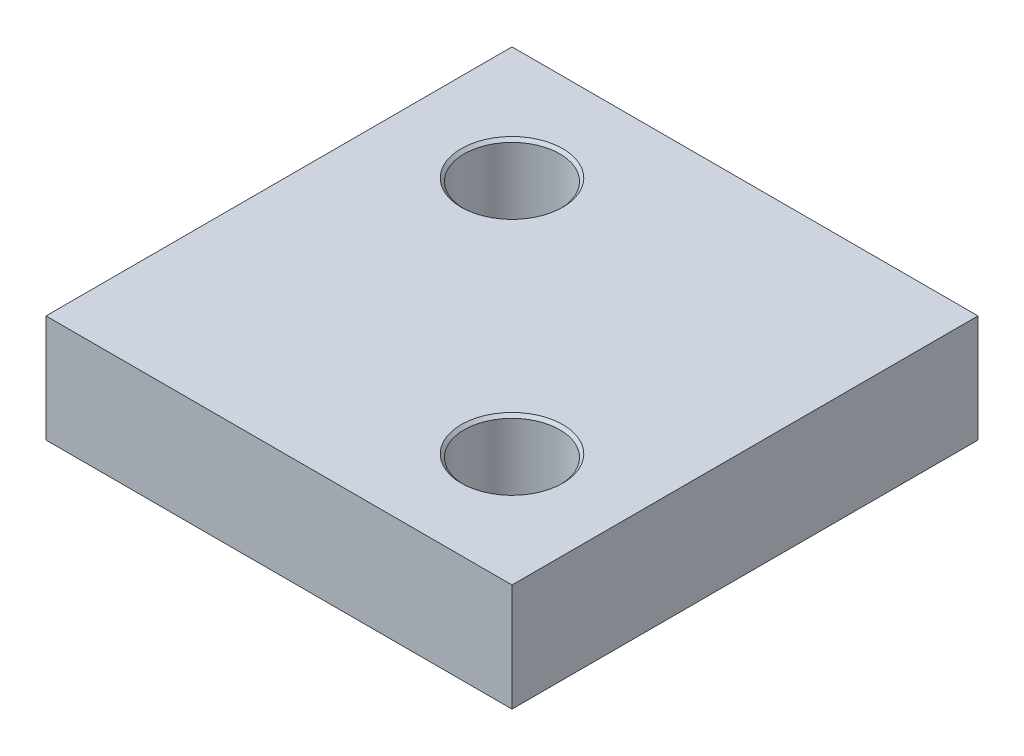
ISO-10303-21;
HEADER;
FILE_DESCRIPTION(('STEP AP214'),'2;1');
FILE_NAME('part.step','',(''),(''),'','','');
FILE_SCHEMA(('AUTOMOTIVE_DESIGN { 1 0 10303 214 1 1 1 1 }'));
ENDSEC;
DATA;
#1=APPLICATION_CONTEXT('core data for automotive mechanical design processes');
#2=APPLICATION_PROTOCOL_DEFINITION('international standard','automotive_design',2000,#1);
#3=PRODUCT_CONTEXT('',#1,'mechanical');
#4=PRODUCT('Part','Part','',(#3));
#5=PRODUCT_RELATED_PRODUCT_CATEGORY('part','',(#4));
#6=PRODUCT_DEFINITION_FORMATION('','',#4);
#7=PRODUCT_DEFINITION_CONTEXT('part definition',#1,'design');
#8=PRODUCT_DEFINITION('design','',#6,#7);
#9=PRODUCT_DEFINITION_SHAPE('','',#8);
#10=(LENGTH_UNIT() NAMED_UNIT(*) SI_UNIT(.MILLI.,.METRE.));
#11=(NAMED_UNIT(*) PLANE_ANGLE_UNIT() SI_UNIT($,.RADIAN.));
#12=(NAMED_UNIT(*) SI_UNIT($,.STERADIAN.) SOLID_ANGLE_UNIT());
#13=UNCERTAINTY_MEASURE_WITH_UNIT(LENGTH_MEASURE(1.E-05),#10,'distance_accuracy_value','');
#14=(GEOMETRIC_REPRESENTATION_CONTEXT(3) GLOBAL_UNCERTAINTY_ASSIGNED_CONTEXT((#13)) GLOBAL_UNIT_ASSIGNED_CONTEXT((#10,
#11,#12)) REPRESENTATION_CONTEXT('',''));
#15=CARTESIAN_POINT('',(0.,0.,0.));
#16=DIRECTION('',(0.,0.,1.));
#17=DIRECTION('',(1.,0.,0.));
#18=AXIS2_PLACEMENT_3D('',#15,#16,#17);
#19=CARTESIAN_POINT('',(0.,36.,0.));
#20=DIRECTION('',(0.,1.,0.));
#21=DIRECTION('',(0.,0.,1.));
#22=AXIS2_PLACEMENT_3D('',#19,#20,#21);
#23=PLANE('',#22);
#24=CARTESIAN_POINT('',(-40.,36.,-40.));
#25=DIRECTION('',(0.,1.,0.));
#26=DIRECTION('',(0.,0.,1.));
#27=AXIS2_PLACEMENT_3D('',#24,#25,#26);
#28=CIRCLE('',#27,17.);
#29=CARTESIAN_POINT('',(-40.,36.,-23.));
#30=VERTEX_POINT('',#29);
#31=EDGE_CURVE('E154',#30,#30,#28,.F.);
#32=ORIENTED_EDGE('',*,*,#31,.T.);
#33=EDGE_LOOP('',(#32));
#34=FACE_BOUND('',#33,.T.);
#35=CARTESIAN_POINT('',(40.,36.,40.));
#36=DIRECTION('',(0.,1.,0.));
#37=DIRECTION('',(0.,0.,1.));
#38=AXIS2_PLACEMENT_3D('',#35,#36,#37);
#39=CIRCLE('',#38,17.);
#40=CARTESIAN_POINT('',(40.,36.,57.));
#41=VERTEX_POINT('',#40);
#42=EDGE_CURVE('E151',#41,#41,#39,.F.);
#43=ORIENTED_EDGE('',*,*,#42,.T.);
#44=EDGE_LOOP('',(#43));
#45=FACE_BOUND('',#44,.T.);
#46=DIRECTION('',(0.,0.,1.));
#47=VECTOR('',#46,1.);
#48=CARTESIAN_POINT('',(-78.,36.,78.));
#49=LINE('',#48,#47);
#50=CARTESIAN_POINT('',(-78.,36.,-78.));
#51=VERTEX_POINT('',#50);
#52=CARTESIAN_POINT('',(-78.,36.,78.));
#53=VERTEX_POINT('',#52);
#54=EDGE_CURVE('E107',#51,#53,#49,.T.);
#55=ORIENTED_EDGE('',*,*,#54,.T.);
#56=DIRECTION('',(1.,0.,0.));
#57=VECTOR('',#56,1.);
#58=CARTESIAN_POINT('',(78.,36.,78.));
#59=LINE('',#58,#57);
#60=CARTESIAN_POINT('',(78.,36.,78.));
#61=VERTEX_POINT('',#60);
#62=EDGE_CURVE('E67',#53,#61,#59,.T.);
#63=ORIENTED_EDGE('',*,*,#62,.T.);
#64=DIRECTION('',(0.,0.,-1.));
#65=VECTOR('',#64,1.);
#66=CARTESIAN_POINT('',(78.,36.,78.));
#67=LINE('',#66,#65);
#68=CARTESIAN_POINT('',(78.,36.,-78.));
#69=VERTEX_POINT('',#68);
#70=EDGE_CURVE('E110',#61,#69,#67,.T.);
#71=ORIENTED_EDGE('',*,*,#70,.T.);
#72=DIRECTION('',(-1.,0.,0.));
#73=VECTOR('',#72,1.);
#74=CARTESIAN_POINT('',(78.,36.,-78.));
#75=LINE('',#74,#73);
#76=EDGE_CURVE('E35',#69,#51,#75,.T.);
#77=ORIENTED_EDGE('',*,*,#76,.T.);
#78=EDGE_LOOP('',(#55,#63,#71,#77));
#79=FACE_BOUND('',#78,.T.);
#80=ADVANCED_FACE('F16',(#34,#45,#79),#23,.T.);
#81=CARTESIAN_POINT('',(0.,0.,0.));
#82=DIRECTION('',(0.,1.,0.));
#83=DIRECTION('',(0.,0.,1.));
#84=AXIS2_PLACEMENT_3D('',#81,#82,#83);
#85=PLANE('',#84);
#86=CARTESIAN_POINT('',(-40.,0.,-40.));
#87=DIRECTION('',(0.,1.,0.));
#88=DIRECTION('',(0.,0.,1.));
#89=AXIS2_PLACEMENT_3D('',#86,#87,#88);
#90=CIRCLE('',#89,17.);
#91=CARTESIAN_POINT('',(-40.,0.,-23.));
#92=VERTEX_POINT('',#91);
#93=EDGE_CURVE('E142',#92,#92,#90,.T.);
#94=ORIENTED_EDGE('',*,*,#93,.T.);
#95=EDGE_LOOP('',(#94));
#96=FACE_BOUND('',#95,.T.);
#97=CARTESIAN_POINT('',(40.,0.,40.));
#98=DIRECTION('',(0.,1.,0.));
#99=DIRECTION('',(0.,0.,1.));
#100=AXIS2_PLACEMENT_3D('',#97,#98,#99);
#101=CIRCLE('',#100,17.);
#102=CARTESIAN_POINT('',(40.,0.,57.));
#103=VERTEX_POINT('',#102);
#104=EDGE_CURVE('E139',#103,#103,#101,.T.);
#105=ORIENTED_EDGE('',*,*,#104,.T.);
#106=EDGE_LOOP('',(#105));
#107=FACE_BOUND('',#106,.T.);
#108=CARTESIAN_POINT('',(66.,0.,40.));
#109=DIRECTION('',(0.,1.,0.));
#110=DIRECTION('',(0.,0.,1.));
#111=AXIS2_PLACEMENT_3D('',#108,#109,#110);
#112=CIRCLE('',#111,3.5);
#113=CARTESIAN_POINT('',(66.,0.,43.5));
#114=VERTEX_POINT('',#113);
#115=EDGE_CURVE('E136',#114,#114,#112,.T.);
#116=ORIENTED_EDGE('',*,*,#115,.T.);
#117=EDGE_LOOP('',(#116));
#118=FACE_BOUND('',#117,.T.);
#119=CARTESIAN_POINT('',(14.,0.,40.));
#120=DIRECTION('',(0.,1.,0.));
#121=DIRECTION('',(0.,0.,1.));
#122=AXIS2_PLACEMENT_3D('',#119,#120,#121);
#123=CIRCLE('',#122,3.5);
#124=CARTESIAN_POINT('',(14.,0.,43.5));
#125=VERTEX_POINT('',#124);
#126=EDGE_CURVE('E133',#125,#125,#123,.T.);
#127=ORIENTED_EDGE('',*,*,#126,.T.);
#128=EDGE_LOOP('',(#127));
#129=FACE_BOUND('',#128,.T.);
#130=CARTESIAN_POINT('',(-14.,0.,-40.));
#131=DIRECTION('',(0.,1.,0.));
#132=DIRECTION('',(0.,0.,1.));
#133=AXIS2_PLACEMENT_3D('',#130,#131,#132);
#134=CIRCLE('',#133,3.5);
#135=CARTESIAN_POINT('',(-14.,0.,-36.5));
#136=VERTEX_POINT('',#135);
#137=EDGE_CURVE('E130',#136,#136,#134,.T.);
#138=ORIENTED_EDGE('',*,*,#137,.T.);
#139=EDGE_LOOP('',(#138));
#140=FACE_BOUND('',#139,.T.);
#141=CARTESIAN_POINT('',(-66.,0.,-40.));
#142=DIRECTION('',(0.,1.,0.));
#143=DIRECTION('',(0.,0.,1.));
#144=AXIS2_PLACEMENT_3D('',#141,#142,#143);
#145=CIRCLE('',#144,3.5);
#146=CARTESIAN_POINT('',(-66.,0.,-36.5));
#147=VERTEX_POINT('',#146);
#148=EDGE_CURVE('E127',#147,#147,#145,.T.);
#149=ORIENTED_EDGE('',*,*,#148,.T.);
#150=EDGE_LOOP('',(#149));
#151=FACE_BOUND('',#150,.T.);
#152=DIRECTION('',(0.,0.,1.));
#153=VECTOR('',#152,1.);
#154=CARTESIAN_POINT('',(-78.,0.,78.));
#155=LINE('',#154,#153);
#156=CARTESIAN_POINT('',(-78.,0.,-78.));
#157=VERTEX_POINT('',#156);
#158=CARTESIAN_POINT('',(-78.,0.,78.));
#159=VERTEX_POINT('',#158);
#160=EDGE_CURVE('E106',#157,#159,#155,.T.);
#161=ORIENTED_EDGE('',*,*,#160,.F.);
#162=DIRECTION('',(-1.,0.,0.));
#163=VECTOR('',#162,1.);
#164=CARTESIAN_POINT('',(78.,0.,-78.));
#165=LINE('',#164,#163);
#166=CARTESIAN_POINT('',(78.,0.,-78.));
#167=VERTEX_POINT('',#166);
#168=EDGE_CURVE('E59',#167,#157,#165,.T.);
#169=ORIENTED_EDGE('',*,*,#168,.F.);
#170=DIRECTION('',(0.,0.,-1.));
#171=VECTOR('',#170,1.);
#172=CARTESIAN_POINT('',(78.,0.,78.));
#173=LINE('',#172,#171);
#174=CARTESIAN_POINT('',(78.,0.,78.));
#175=VERTEX_POINT('',#174);
#176=EDGE_CURVE('E53',#175,#167,#173,.T.);
#177=ORIENTED_EDGE('',*,*,#176,.F.);
#178=DIRECTION('',(1.,0.,0.));
#179=VECTOR('',#178,1.);
#180=CARTESIAN_POINT('',(78.,0.,78.));
#181=LINE('',#180,#179);
#182=EDGE_CURVE('E116',#159,#175,#181,.T.);
#183=ORIENTED_EDGE('',*,*,#182,.F.);
#184=EDGE_LOOP('',(#161,#169,#177,#183));
#185=FACE_BOUND('',#184,.T.);
#186=ADVANCED_FACE('F203',(#96,#107,#118,#129,#140,#151,#185),#85,.F.);
#187=CARTESIAN_POINT('',(-78.,36.,78.));
#188=DIRECTION('',(1.,0.,0.));
#189=DIRECTION('',(0.,0.,-1.));
#190=AXIS2_PLACEMENT_3D('',#187,#188,#189);
#191=PLANE('',#190);
#192=ORIENTED_EDGE('',*,*,#160,.T.);
#193=DIRECTION('',(0.,-1.,0.));
#194=VECTOR('',#193,1.);
#195=CARTESIAN_POINT('',(-78.,36.,78.));
#196=LINE('',#195,#194);
#197=EDGE_CURVE('E125',#53,#159,#196,.T.);
#198=ORIENTED_EDGE('',*,*,#197,.F.);
#199=ORIENTED_EDGE('',*,*,#54,.F.);
#200=DIRECTION('',(0.,-1.,0.));
#201=VECTOR('',#200,1.);
#202=CARTESIAN_POINT('',(-78.,36.,-78.));
#203=LINE('',#202,#201);
#204=EDGE_CURVE('E113',#51,#157,#203,.T.);
#205=ORIENTED_EDGE('',*,*,#204,.T.);
#206=EDGE_LOOP('',(#192,#198,#199,#205));
#207=FACE_BOUND('',#206,.T.);
#208=ADVANCED_FACE('F210',(#207),#191,.F.);
#209=CARTESIAN_POINT('',(78.,36.,78.));
#210=DIRECTION('',(0.,0.,-1.));
#211=DIRECTION('',(-1.,0.,0.));
#212=AXIS2_PLACEMENT_3D('',#209,#210,#211);
#213=PLANE('',#212);
#214=ORIENTED_EDGE('',*,*,#182,.T.);
#215=DIRECTION('',(0.,-1.,0.));
#216=VECTOR('',#215,1.);
#217=CARTESIAN_POINT('',(78.,36.,78.));
#218=LINE('',#217,#216);
#219=EDGE_CURVE('E123',#61,#175,#218,.T.);
#220=ORIENTED_EDGE('',*,*,#219,.F.);
#221=ORIENTED_EDGE('',*,*,#62,.F.);
#222=ORIENTED_EDGE('',*,*,#197,.T.);
#223=EDGE_LOOP('',(#214,#220,#221,#222));
#224=FACE_BOUND('',#223,.T.);
#225=ADVANCED_FACE('F224',(#224),#213,.F.);
#226=CARTESIAN_POINT('',(78.,36.,78.));
#227=DIRECTION('',(-1.,0.,0.));
#228=DIRECTION('',(0.,0.,1.));
#229=AXIS2_PLACEMENT_3D('',#226,#227,#228);
#230=PLANE('',#229);
#231=ORIENTED_EDGE('',*,*,#176,.T.);
#232=DIRECTION('',(0.,-1.,0.));
#233=VECTOR('',#232,1.);
#234=CARTESIAN_POINT('',(78.,36.,-78.));
#235=LINE('',#234,#233);
#236=EDGE_CURVE('E121',#69,#167,#235,.T.);
#237=ORIENTED_EDGE('',*,*,#236,.F.);
#238=ORIENTED_EDGE('',*,*,#70,.F.);
#239=ORIENTED_EDGE('',*,*,#219,.T.);
#240=EDGE_LOOP('',(#231,#237,#238,#239));
#241=FACE_BOUND('',#240,.T.);
#242=ADVANCED_FACE('F221',(#241),#230,.F.);
#243=CARTESIAN_POINT('',(78.,36.,-78.));
#244=DIRECTION('',(0.,0.,1.));
#245=DIRECTION('',(1.,0.,0.));
#246=AXIS2_PLACEMENT_3D('',#243,#244,#245);
#247=PLANE('',#246);
#248=ORIENTED_EDGE('',*,*,#168,.T.);
#249=ORIENTED_EDGE('',*,*,#204,.F.);
#250=ORIENTED_EDGE('',*,*,#76,.F.);
#251=ORIENTED_EDGE('',*,*,#236,.T.);
#252=EDGE_LOOP('',(#248,#249,#250,#251));
#253=FACE_BOUND('',#252,.T.);
#254=ADVANCED_FACE('F218',(#253),#247,.F.);
#255=CARTESIAN_POINT('',(-40.,36.,-40.));
#256=DIRECTION('',(0.,-1.,0.));
#257=DIRECTION('',(0.,0.,-1.));
#258=AXIS2_PLACEMENT_3D('',#255,#256,#257);
#259=CYLINDRICAL_SURFACE('',#258,16.);
#260=CARTESIAN_POINT('',(-40.,1.,-40.));
#261=DIRECTION('',(0.,1.,0.));
#262=DIRECTION('',(0.,0.,1.));
#263=AXIS2_PLACEMENT_3D('',#260,#261,#262);
#264=CIRCLE('',#263,16.);
#265=CARTESIAN_POINT('',(-40.,1.,-24.));
#266=VERTEX_POINT('',#265);
#267=EDGE_CURVE('E148',#266,#266,#264,.F.);
#268=ORIENTED_EDGE('',*,*,#267,.T.);
#269=EDGE_LOOP('',(#268));
#270=FACE_BOUND('',#269,.T.);
#271=CARTESIAN_POINT('',(-40.,35.,-40.));
#272=DIRECTION('',(0.,1.,0.));
#273=DIRECTION('',(0.,0.,1.));
#274=AXIS2_PLACEMENT_3D('',#271,#272,#273);
#275=CIRCLE('',#274,16.);
#276=CARTESIAN_POINT('',(-40.,35.,-24.));
#277=VERTEX_POINT('',#276);
#278=EDGE_CURVE('E145',#277,#277,#275,.T.);
#279=ORIENTED_EDGE('',*,*,#278,.T.);
#280=EDGE_LOOP('',(#279));
#281=FACE_BOUND('',#280,.T.);
#282=ADVANCED_FACE('F215',(#270,#281),#259,.F.);
#283=CARTESIAN_POINT('',(40.,36.,40.));
#284=DIRECTION('',(0.,-1.,0.));
#285=DIRECTION('',(0.,0.,-1.));
#286=AXIS2_PLACEMENT_3D('',#283,#284,#285);
#287=CYLINDRICAL_SURFACE('',#286,16.);
#288=CARTESIAN_POINT('',(40.,1.,40.));
#289=DIRECTION('',(0.,1.,0.));
#290=DIRECTION('',(0.,0.,1.));
#291=AXIS2_PLACEMENT_3D('',#288,#289,#290);
#292=CIRCLE('',#291,16.);
#293=CARTESIAN_POINT('',(40.,1.,56.));
#294=VERTEX_POINT('',#293);
#295=EDGE_CURVE('E10',#294,#294,#292,.F.);
#296=ORIENTED_EDGE('',*,*,#295,.T.);
#297=EDGE_LOOP('',(#296));
#298=FACE_BOUND('',#297,.T.);
#299=CARTESIAN_POINT('',(40.,35.,40.));
#300=DIRECTION('',(0.,1.,0.));
#301=DIRECTION('',(0.,0.,1.));
#302=AXIS2_PLACEMENT_3D('',#299,#300,#301);
#303=CIRCLE('',#302,16.);
#304=CARTESIAN_POINT('',(40.,35.,56.));
#305=VERTEX_POINT('',#304);
#306=EDGE_CURVE('E26',#305,#305,#303,.T.);
#307=ORIENTED_EDGE('',*,*,#306,.T.);
#308=EDGE_LOOP('',(#307));
#309=FACE_BOUND('',#308,.T.);
#310=ADVANCED_FACE('F234',(#298,#309),#287,.F.);
#311=CARTESIAN_POINT('',(-40.,0.,-40.));
#312=DIRECTION('',(0.,-1.,0.));
#313=DIRECTION('',(0.,0.,-1.));
#314=AXIS2_PLACEMENT_3D('',#311,#312,#313);
#315=CONICAL_SURFACE('',#314,17.,0.785398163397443);
#316=ORIENTED_EDGE('',*,*,#267,.F.);
#317=EDGE_LOOP('',(#316));
#318=FACE_BOUND('',#317,.T.);
#319=ORIENTED_EDGE('',*,*,#93,.F.);
#320=EDGE_LOOP('',(#319));
#321=FACE_BOUND('',#320,.T.);
#322=ADVANCED_FACE('F230',(#318,#321),#315,.F.);
#323=CARTESIAN_POINT('',(-40.,35.,-40.));
#324=DIRECTION('',(0.,1.,0.));
#325=DIRECTION('',(0.,0.,1.));
#326=AXIS2_PLACEMENT_3D('',#323,#324,#325);
#327=CONICAL_SURFACE('',#326,16.,0.785398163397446);
#328=ORIENTED_EDGE('',*,*,#31,.F.);
#329=EDGE_LOOP('',(#328));
#330=FACE_BOUND('',#329,.T.);
#331=ORIENTED_EDGE('',*,*,#278,.F.);
#332=EDGE_LOOP('',(#331));
#333=FACE_BOUND('',#332,.T.);
#334=ADVANCED_FACE('F233',(#330,#333),#327,.F.);
#335=CARTESIAN_POINT('',(40.,0.,40.));
#336=DIRECTION('',(0.,-1.,0.));
#337=DIRECTION('',(0.,0.,-1.));
#338=AXIS2_PLACEMENT_3D('',#335,#336,#337);
#339=CONICAL_SURFACE('',#338,17.,0.785398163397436);
#340=ORIENTED_EDGE('',*,*,#295,.F.);
#341=EDGE_LOOP('',(#340));
#342=FACE_BOUND('',#341,.T.);
#343=ORIENTED_EDGE('',*,*,#104,.F.);
#344=EDGE_LOOP('',(#343));
#345=FACE_BOUND('',#344,.T.);
#346=ADVANCED_FACE('F238',(#342,#345),#339,.F.);
#347=CARTESIAN_POINT('',(40.,35.,40.));
#348=DIRECTION('',(0.,1.,0.));
#349=DIRECTION('',(0.,0.,1.));
#350=AXIS2_PLACEMENT_3D('',#347,#348,#349);
#351=CONICAL_SURFACE('',#350,16.,0.785398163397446);
#352=ORIENTED_EDGE('',*,*,#42,.F.);
#353=EDGE_LOOP('',(#352));
#354=FACE_BOUND('',#353,.T.);
#355=ORIENTED_EDGE('',*,*,#306,.F.);
#356=EDGE_LOOP('',(#355));
#357=FACE_BOUND('',#356,.T.);
#358=ADVANCED_FACE('F242',(#354,#357),#351,.F.);
#359=CARTESIAN_POINT('',(66.,1.,40.));
#360=DIRECTION('',(0.,-1.,0.));
#361=DIRECTION('',(0.,0.,-1.));
#362=AXIS2_PLACEMENT_3D('',#359,#360,#361);
#363=CONICAL_SURFACE('',#362,2.5,0.785398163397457);
#364=CARTESIAN_POINT('',(66.,0.499999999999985,40.));
#365=DIRECTION('',(0.,-1.,0.));
#366=DIRECTION('',(0.,0.,-1.));
#367=AXIS2_PLACEMENT_3D('',#364,#365,#366);
#368=CIRCLE('',#367,3.);
#369=CARTESIAN_POINT('',(66.,0.499999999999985,37.));
#370=VERTEX_POINT('',#369);
#371=EDGE_CURVE('E169',#370,#370,#368,.T.);
#372=ORIENTED_EDGE('',*,*,#371,.F.);
#373=EDGE_LOOP('',(#372));
#374=FACE_BOUND('',#373,.T.);
#375=ORIENTED_EDGE('',*,*,#115,.F.);
#376=EDGE_LOOP('',(#375));
#377=FACE_BOUND('',#376,.T.);
#378=ADVANCED_FACE('F246',(#374,#377),#363,.F.);
#379=CARTESIAN_POINT('',(14.,1.,40.));
#380=DIRECTION('',(0.,-1.,0.));
#381=DIRECTION('',(0.,0.,-1.));
#382=AXIS2_PLACEMENT_3D('',#379,#380,#381);
#383=CONICAL_SURFACE('',#382,2.5,0.785398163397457);
#384=CARTESIAN_POINT('',(14.,0.499999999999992,40.));
#385=DIRECTION('',(0.,-1.,0.));
#386=DIRECTION('',(0.,0.,-1.));
#387=AXIS2_PLACEMENT_3D('',#384,#385,#386);
#388=CIRCLE('',#387,3.);
#389=CARTESIAN_POINT('',(14.,0.499999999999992,37.));
#390=VERTEX_POINT('',#389);
#391=EDGE_CURVE('E166',#390,#390,#388,.T.);
#392=ORIENTED_EDGE('',*,*,#391,.F.);
#393=EDGE_LOOP('',(#392));
#394=FACE_BOUND('',#393,.T.);
#395=ORIENTED_EDGE('',*,*,#126,.F.);
#396=EDGE_LOOP('',(#395));
#397=FACE_BOUND('',#396,.T.);
#398=ADVANCED_FACE('F250',(#394,#397),#383,.F.);
#399=CARTESIAN_POINT('',(-14.,0.999999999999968,-40.));
#400=DIRECTION('',(0.,-1.,0.));
#401=DIRECTION('',(0.,0.,-1.));
#402=AXIS2_PLACEMENT_3D('',#399,#400,#401);
#403=CONICAL_SURFACE('',#402,2.5,0.785398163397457);
#404=CARTESIAN_POINT('',(-14.,0.499999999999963,-40.));
#405=DIRECTION('',(0.,-1.,0.));
#406=DIRECTION('',(0.,0.,-1.));
#407=AXIS2_PLACEMENT_3D('',#404,#405,#406);
#408=CIRCLE('',#407,3.);
#409=CARTESIAN_POINT('',(-14.,0.499999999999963,-43.));
#410=VERTEX_POINT('',#409);
#411=EDGE_CURVE('E162',#410,#410,#408,.T.);
#412=ORIENTED_EDGE('',*,*,#411,.F.);
#413=EDGE_LOOP('',(#412));
#414=FACE_BOUND('',#413,.T.);
#415=ORIENTED_EDGE('',*,*,#137,.F.);
#416=EDGE_LOOP('',(#415));
#417=FACE_BOUND('',#416,.T.);
#418=ADVANCED_FACE('F253',(#414,#417),#403,.F.);
#419=CARTESIAN_POINT('',(-66.,1.,-40.));
#420=DIRECTION('',(0.,-1.,0.));
#421=DIRECTION('',(0.,0.,-1.));
#422=AXIS2_PLACEMENT_3D('',#419,#420,#421);
#423=CONICAL_SURFACE('',#422,2.5,0.785398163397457);
#424=CARTESIAN_POINT('',(-66.,0.499999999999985,-40.));
#425=DIRECTION('',(0.,-1.,0.));
#426=DIRECTION('',(0.,0.,-1.));
#427=AXIS2_PLACEMENT_3D('',#424,#425,#426);
#428=CIRCLE('',#427,3.);
#429=CARTESIAN_POINT('',(-66.,0.499999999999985,-43.));
#430=VERTEX_POINT('',#429);
#431=EDGE_CURVE('E159',#430,#430,#428,.T.);
#432=ORIENTED_EDGE('',*,*,#431,.F.);
#433=EDGE_LOOP('',(#432));
#434=FACE_BOUND('',#433,.T.);
#435=ORIENTED_EDGE('',*,*,#148,.F.);
#436=EDGE_LOOP('',(#435));
#437=FACE_BOUND('',#436,.T.);
#438=ADVANCED_FACE('F18',(#434,#437),#423,.F.);
#439=CARTESIAN_POINT('',(-66.,15.,-40.));
#440=DIRECTION('',(0.,-1.,0.));
#441=DIRECTION('',(0.,0.,-1.));
#442=AXIS2_PLACEMENT_3D('',#439,#440,#441);
#443=PLANE('',#442);
#444=CARTESIAN_POINT('',(-66.,15.,-40.));
#445=DIRECTION('',(0.,-1.,0.));
#446=DIRECTION('',(0.,0.,-1.));
#447=AXIS2_PLACEMENT_3D('',#444,#445,#446);
#448=CIRCLE('',#447,3.);
#449=CARTESIAN_POINT('',(-66.,15.,-43.));
#450=VERTEX_POINT('',#449);
#451=EDGE_CURVE('E98',#450,#450,#448,.T.);
#452=ORIENTED_EDGE('',*,*,#451,.T.);
#453=EDGE_LOOP('',(#452));
#454=FACE_BOUND('',#453,.T.);
#455=CARTESIAN_POINT('',(-66.,15.,-40.));
#456=DIRECTION('',(0.,-1.,0.));
#457=DIRECTION('',(0.,0.,-1.));
#458=AXIS2_PLACEMENT_3D('',#455,#456,#457);
#459=CIRCLE('',#458,2.5);
#460=CARTESIAN_POINT('',(-66.,15.,-42.5));
#461=VERTEX_POINT('',#460);
#462=EDGE_CURVE('E20',#461,#461,#459,.F.);
#463=ORIENTED_EDGE('',*,*,#462,.T.);
#464=EDGE_LOOP('',(#463));
#465=FACE_BOUND('',#464,.T.);
#466=ADVANCED_FACE('F261',(#454,#465),#443,.T.);
#467=CARTESIAN_POINT('',(-66.,15.,-40.));
#468=DIRECTION('',(0.,-1.,0.));
#469=DIRECTION('',(0.,0.,-1.));
#470=AXIS2_PLACEMENT_3D('',#467,#468,#469);
#471=CYLINDRICAL_SURFACE('',#470,3.);
#472=ORIENTED_EDGE('',*,*,#431,.T.);
#473=EDGE_LOOP('',(#472));
#474=FACE_BOUND('',#473,.T.);
#475=ORIENTED_EDGE('',*,*,#451,.F.);
#476=EDGE_LOOP('',(#475));
#477=FACE_BOUND('',#476,.T.);
#478=ADVANCED_FACE('F313',(#474,#477),#471,.F.);
#479=CARTESIAN_POINT('',(-14.,15.,-40.));
#480=DIRECTION('',(0.,-1.,0.));
#481=DIRECTION('',(0.,0.,-1.));
#482=AXIS2_PLACEMENT_3D('',#479,#480,#481);
#483=PLANE('',#482);
#484=CARTESIAN_POINT('',(-14.,15.,-40.));
#485=DIRECTION('',(0.,-1.,0.));
#486=DIRECTION('',(0.,0.,-1.));
#487=AXIS2_PLACEMENT_3D('',#484,#485,#486);
#488=CIRCLE('',#487,3.);
#489=CARTESIAN_POINT('',(-14.,15.,-43.));
#490=VERTEX_POINT('',#489);
#491=EDGE_CURVE('E283',#490,#490,#488,.T.);
#492=ORIENTED_EDGE('',*,*,#491,.T.);
#493=EDGE_LOOP('',(#492));
#494=FACE_BOUND('',#493,.T.);
#495=CARTESIAN_POINT('',(-14.,15.,-40.));
#496=DIRECTION('',(0.,-1.,0.));
#497=DIRECTION('',(0.,0.,-1.));
#498=AXIS2_PLACEMENT_3D('',#495,#496,#497);
#499=CIRCLE('',#498,2.5);
#500=CARTESIAN_POINT('',(-14.,15.,-42.5));
#501=VERTEX_POINT('',#500);
#502=EDGE_CURVE('E96',#501,#501,#499,.F.);
#503=ORIENTED_EDGE('',*,*,#502,.T.);
#504=EDGE_LOOP('',(#503));
#505=FACE_BOUND('',#504,.T.);
#506=ADVANCED_FACE('F180',(#494,#505),#483,.T.);
#507=CARTESIAN_POINT('',(-14.,15.,-40.));
#508=DIRECTION('',(0.,-1.,0.));
#509=DIRECTION('',(0.,0.,-1.));
#510=AXIS2_PLACEMENT_3D('',#507,#508,#509);
#511=CYLINDRICAL_SURFACE('',#510,3.);
#512=ORIENTED_EDGE('',*,*,#411,.T.);
#513=EDGE_LOOP('',(#512));
#514=FACE_BOUND('',#513,.T.);
#515=ORIENTED_EDGE('',*,*,#491,.F.);
#516=EDGE_LOOP('',(#515));
#517=FACE_BOUND('',#516,.T.);
#518=ADVANCED_FACE('F276',(#514,#517),#511,.F.);
#519=CARTESIAN_POINT('',(14.,15.,40.));
#520=DIRECTION('',(0.,-1.,0.));
#521=DIRECTION('',(0.,0.,-1.));
#522=AXIS2_PLACEMENT_3D('',#519,#520,#521);
#523=PLANE('',#522);
#524=CARTESIAN_POINT('',(14.,15.,40.));
#525=DIRECTION('',(0.,-1.,0.));
#526=DIRECTION('',(0.,0.,-1.));
#527=AXIS2_PLACEMENT_3D('',#524,#525,#526);
#528=CIRCLE('',#527,3.);
#529=CARTESIAN_POINT('',(14.,15.,37.));
#530=VERTEX_POINT('',#529);
#531=EDGE_CURVE('E285',#530,#530,#528,.T.);
#532=ORIENTED_EDGE('',*,*,#531,.T.);
#533=EDGE_LOOP('',(#532));
#534=FACE_BOUND('',#533,.T.);
#535=CARTESIAN_POINT('',(14.,15.,40.));
#536=DIRECTION('',(0.,-1.,0.));
#537=DIRECTION('',(0.,0.,-1.));
#538=AXIS2_PLACEMENT_3D('',#535,#536,#537);
#539=CIRCLE('',#538,2.5);
#540=CARTESIAN_POINT('',(14.,15.,37.5));
#541=VERTEX_POINT('',#540);
#542=EDGE_CURVE('E172',#541,#541,#539,.F.);
#543=ORIENTED_EDGE('',*,*,#542,.T.);
#544=EDGE_LOOP('',(#543));
#545=FACE_BOUND('',#544,.T.);
#546=ADVANCED_FACE('F279',(#534,#545),#523,.T.);
#547=CARTESIAN_POINT('',(14.,15.,40.));
#548=DIRECTION('',(0.,-1.,0.));
#549=DIRECTION('',(0.,0.,-1.));
#550=AXIS2_PLACEMENT_3D('',#547,#548,#549);
#551=CYLINDRICAL_SURFACE('',#550,3.);
#552=ORIENTED_EDGE('',*,*,#391,.T.);
#553=EDGE_LOOP('',(#552));
#554=FACE_BOUND('',#553,.T.);
#555=ORIENTED_EDGE('',*,*,#531,.F.);
#556=EDGE_LOOP('',(#555));
#557=FACE_BOUND('',#556,.T.);
#558=ADVANCED_FACE('F303',(#554,#557),#551,.F.);
#559=CARTESIAN_POINT('',(66.,15.,40.));
#560=DIRECTION('',(0.,-1.,0.));
#561=DIRECTION('',(0.,0.,-1.));
#562=AXIS2_PLACEMENT_3D('',#559,#560,#561);
#563=PLANE('',#562);
#564=CARTESIAN_POINT('',(66.,15.,40.));
#565=DIRECTION('',(0.,-1.,0.));
#566=DIRECTION('',(0.,0.,-1.));
#567=AXIS2_PLACEMENT_3D('',#564,#565,#566);
#568=CIRCLE('',#567,3.);
#569=CARTESIAN_POINT('',(66.,15.,37.));
#570=VERTEX_POINT('',#569);
#571=EDGE_CURVE('E163',#570,#570,#568,.T.);
#572=ORIENTED_EDGE('',*,*,#571,.T.);
#573=EDGE_LOOP('',(#572));
#574=FACE_BOUND('',#573,.T.);
#575=CARTESIAN_POINT('',(66.,15.,40.));
#576=DIRECTION('',(0.,-1.,0.));
#577=DIRECTION('',(0.,0.,-1.));
#578=AXIS2_PLACEMENT_3D('',#575,#576,#577);
#579=CIRCLE('',#578,2.5);
#580=CARTESIAN_POINT('',(66.,15.,37.5));
#581=VERTEX_POINT('',#580);
#582=EDGE_CURVE('E175',#581,#581,#579,.F.);
#583=ORIENTED_EDGE('',*,*,#582,.T.);
#584=EDGE_LOOP('',(#583));
#585=FACE_BOUND('',#584,.T.);
#586=ADVANCED_FACE('F293',(#574,#585),#563,.T.);
#587=CARTESIAN_POINT('',(66.,15.,40.));
#588=DIRECTION('',(0.,-1.,0.));
#589=DIRECTION('',(0.,0.,-1.));
#590=AXIS2_PLACEMENT_3D('',#587,#588,#589);
#591=CYLINDRICAL_SURFACE('',#590,3.);
#592=ORIENTED_EDGE('',*,*,#371,.T.);
#593=EDGE_LOOP('',(#592));
#594=FACE_BOUND('',#593,.T.);
#595=ORIENTED_EDGE('',*,*,#571,.F.);
#596=EDGE_LOOP('',(#595));
#597=FACE_BOUND('',#596,.T.);
#598=ADVANCED_FACE('F84',(#594,#597),#591,.F.);
#599=CARTESIAN_POINT('',(14.,18.,40.));
#600=DIRECTION('',(0.,-1.,0.));
#601=DIRECTION('',(0.,0.,-1.));
#602=AXIS2_PLACEMENT_3D('',#599,#600,#601);
#603=CONICAL_SURFACE('',#602,2.5,1.02974425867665);
#604=CARTESIAN_POINT('',(14.,19.5021515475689,40.));
#605=VERTEX_POINT('',#604);
#606=VERTEX_LOOP('',#605);
#607=FACE_BOUND('',#606,.T.);
#608=CARTESIAN_POINT('',(14.,18.,40.));
#609=DIRECTION('',(0.,-1.,0.));
#610=DIRECTION('',(0.,0.,-1.));
#611=AXIS2_PLACEMENT_3D('',#608,#609,#610);
#612=CIRCLE('',#611,2.5);
#613=CARTESIAN_POINT('',(14.,18.,37.5));
#614=VERTEX_POINT('',#613);
#615=EDGE_CURVE('E88',#614,#614,#612,.T.);
#616=ORIENTED_EDGE('',*,*,#615,.T.);
#617=EDGE_LOOP('',(#616));
#618=FACE_BOUND('',#617,.T.);
#619=ADVANCED_FACE('F80',(#607,#618),#603,.F.);
#620=CARTESIAN_POINT('',(14.,0.,40.));
#621=DIRECTION('',(0.,-1.,0.));
#622=DIRECTION('',(0.,0.,-1.));
#623=AXIS2_PLACEMENT_3D('',#620,#621,#622);
#624=CYLINDRICAL_SURFACE('',#623,2.5);
#625=ORIENTED_EDGE('',*,*,#615,.F.);
#626=EDGE_LOOP('',(#625));
#627=FACE_BOUND('',#626,.T.);
#628=ORIENTED_EDGE('',*,*,#542,.F.);
#629=EDGE_LOOP('',(#628));
#630=FACE_BOUND('',#629,.T.);
#631=ADVANCED_FACE('F83',(#627,#630),#624,.F.);
#632=CARTESIAN_POINT('',(66.,18.,40.));
#633=DIRECTION('',(0.,-1.,0.));
#634=DIRECTION('',(0.,0.,-1.));
#635=AXIS2_PLACEMENT_3D('',#632,#633,#634);
#636=CONICAL_SURFACE('',#635,2.5,1.02974425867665);
#637=CARTESIAN_POINT('',(66.,19.5021515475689,40.));
#638=VERTEX_POINT('',#637);
#639=VERTEX_LOOP('',#638);
#640=FACE_BOUND('',#639,.T.);
#641=CARTESIAN_POINT('',(66.,18.,40.));
#642=DIRECTION('',(0.,-1.,0.));
#643=DIRECTION('',(0.,0.,-1.));
#644=AXIS2_PLACEMENT_3D('',#641,#642,#643);
#645=CIRCLE('',#644,2.5);
#646=CARTESIAN_POINT('',(66.,18.,37.5));
#647=VERTEX_POINT('',#646);
#648=EDGE_CURVE('E90',#647,#647,#645,.T.);
#649=ORIENTED_EDGE('',*,*,#648,.T.);
#650=EDGE_LOOP('',(#649));
#651=FACE_BOUND('',#650,.T.);
#652=ADVANCED_FACE('F322',(#640,#651),#636,.F.);
#653=CARTESIAN_POINT('',(66.,0.,40.));
#654=DIRECTION('',(0.,-1.,0.));
#655=DIRECTION('',(0.,0.,-1.));
#656=AXIS2_PLACEMENT_3D('',#653,#654,#655);
#657=CYLINDRICAL_SURFACE('',#656,2.5);
#658=ORIENTED_EDGE('',*,*,#648,.F.);
#659=EDGE_LOOP('',(#658));
#660=FACE_BOUND('',#659,.T.);
#661=ORIENTED_EDGE('',*,*,#582,.F.);
#662=EDGE_LOOP('',(#661));
#663=FACE_BOUND('',#662,.T.);
#664=ADVANCED_FACE('F197',(#660,#663),#657,.F.);
#665=CARTESIAN_POINT('',(-14.,18.,-40.));
#666=DIRECTION('',(0.,-1.,0.));
#667=DIRECTION('',(0.,0.,-1.));
#668=AXIS2_PLACEMENT_3D('',#665,#666,#667);
#669=CONICAL_SURFACE('',#668,2.5,1.02974425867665);
#670=CARTESIAN_POINT('',(-14.,19.5021515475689,-40.));
#671=VERTEX_POINT('',#670);
#672=VERTEX_LOOP('',#671);
#673=FACE_BOUND('',#672,.T.);
#674=CARTESIAN_POINT('',(-14.,18.,-40.));
#675=DIRECTION('',(0.,-1.,0.));
#676=DIRECTION('',(0.,0.,-1.));
#677=AXIS2_PLACEMENT_3D('',#674,#675,#676);
#678=CIRCLE('',#677,2.5);
#679=CARTESIAN_POINT('',(-14.,18.,-42.5));
#680=VERTEX_POINT('',#679);
#681=EDGE_CURVE('E93',#680,#680,#678,.T.);
#682=ORIENTED_EDGE('',*,*,#681,.T.);
#683=EDGE_LOOP('',(#682));
#684=FACE_BOUND('',#683,.T.);
#685=ADVANCED_FACE('F185',(#673,#684),#669,.F.);
#686=CARTESIAN_POINT('',(-14.,0.,-40.));
#687=DIRECTION('',(0.,-1.,0.));
#688=DIRECTION('',(0.,0.,-1.));
#689=AXIS2_PLACEMENT_3D('',#686,#687,#688);
#690=CYLINDRICAL_SURFACE('',#689,2.5);
#691=ORIENTED_EDGE('',*,*,#681,.F.);
#692=EDGE_LOOP('',(#691));
#693=FACE_BOUND('',#692,.T.);
#694=ORIENTED_EDGE('',*,*,#502,.F.);
#695=EDGE_LOOP('',(#694));
#696=FACE_BOUND('',#695,.T.);
#697=ADVANCED_FACE('F182',(#693,#696),#690,.F.);
#698=CARTESIAN_POINT('',(-66.,18.,-40.));
#699=DIRECTION('',(0.,-1.,0.));
#700=DIRECTION('',(0.,0.,-1.));
#701=AXIS2_PLACEMENT_3D('',#698,#699,#700);
#702=CONICAL_SURFACE('',#701,2.5,1.02974425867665);
#703=CARTESIAN_POINT('',(-66.,19.5021515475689,-40.));
#704=VERTEX_POINT('',#703);
#705=VERTEX_LOOP('',#704);
#706=FACE_BOUND('',#705,.T.);
#707=CARTESIAN_POINT('',(-66.,18.,-40.));
#708=DIRECTION('',(0.,-1.,0.));
#709=DIRECTION('',(0.,0.,-1.));
#710=AXIS2_PLACEMENT_3D('',#707,#708,#709);
#711=CIRCLE('',#710,2.5);
#712=CARTESIAN_POINT('',(-66.,18.,-42.5));
#713=VERTEX_POINT('',#712);
#714=EDGE_CURVE('E103',#713,#713,#711,.T.);
#715=ORIENTED_EDGE('',*,*,#714,.T.);
#716=EDGE_LOOP('',(#715));
#717=FACE_BOUND('',#716,.T.);
#718=ADVANCED_FACE('F184',(#706,#717),#702,.F.);
#719=CARTESIAN_POINT('',(-66.,0.,-40.));
#720=DIRECTION('',(0.,-1.,0.));
#721=DIRECTION('',(0.,0.,-1.));
#722=AXIS2_PLACEMENT_3D('',#719,#720,#721);
#723=CYLINDRICAL_SURFACE('',#722,2.5);
#724=ORIENTED_EDGE('',*,*,#714,.F.);
#725=EDGE_LOOP('',(#724));
#726=FACE_BOUND('',#725,.T.);
#727=ORIENTED_EDGE('',*,*,#462,.F.);
#728=EDGE_LOOP('',(#727));
#729=FACE_BOUND('',#728,.T.);
#730=ADVANCED_FACE('F194',(#726,#729),#723,.F.);
#731=CLOSED_SHELL('',(#80,#186,#208,#225,#242,#254,#282,#310,#322,#334,#346,#358,#378,#398,#418,
#438,#466,#478,#506,#518,#546,#558,#586,#598,#619,#631,#652,#664,#685,#697,#718,#730));
#732=MANIFOLD_SOLID_BREP('B1',#731);
#733=ADVANCED_BREP_SHAPE_REPRESENTATION('',(#18,#732),#14);
#734=SHAPE_DEFINITION_REPRESENTATION(#9,#733);
ENDSEC;
END-ISO-10303-21;
